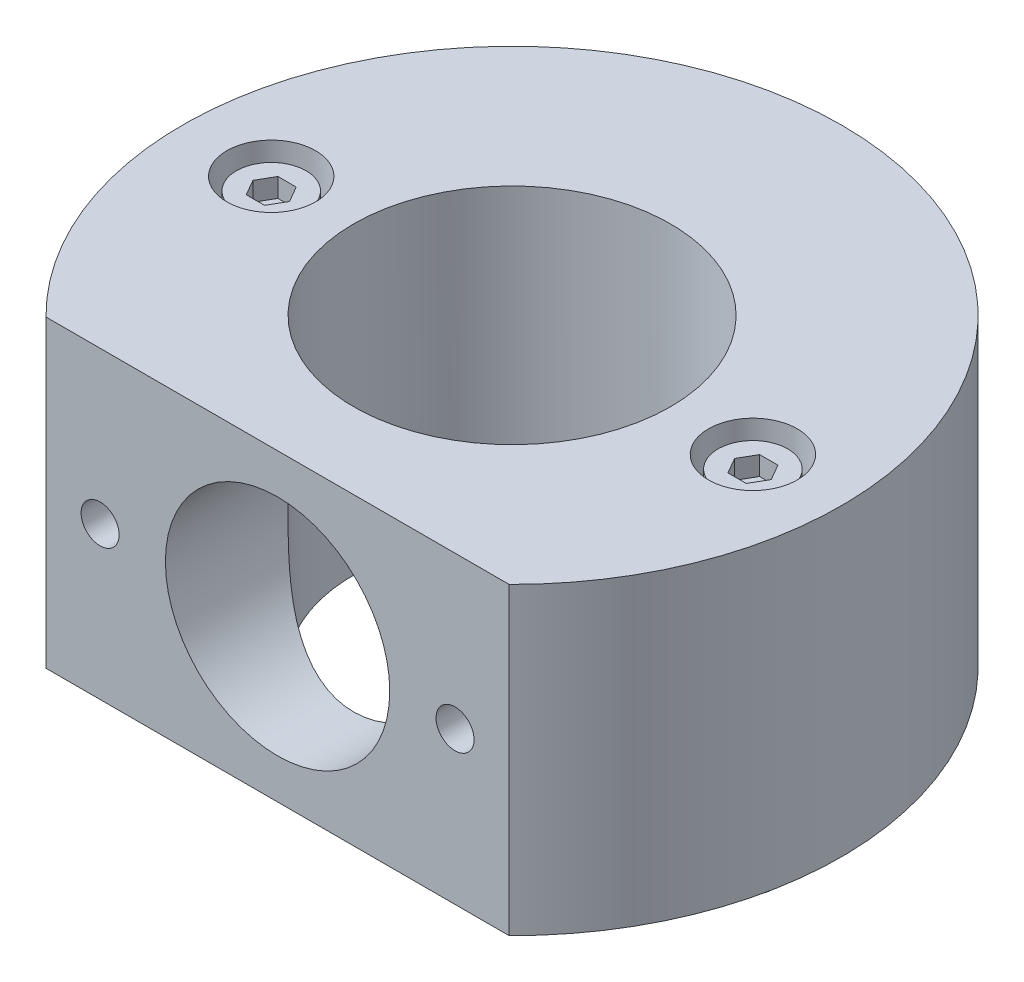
ISO-10303-21;
HEADER;
FILE_DESCRIPTION(('STEP AP214'),'2;1');
FILE_NAME('part.step','',(''),(''),'','','');
FILE_SCHEMA(('AUTOMOTIVE_DESIGN { 1 0 10303 214 1 1 1 1 }'));
ENDSEC;
DATA;
#1=APPLICATION_CONTEXT('core data for automotive mechanical design processes');
#2=APPLICATION_PROTOCOL_DEFINITION('international standard','automotive_design',2000,#1);
#3=PRODUCT_CONTEXT('',#1,'mechanical');
#4=PRODUCT('Part','Part','',(#3));
#5=PRODUCT_RELATED_PRODUCT_CATEGORY('part','',(#4));
#6=PRODUCT_DEFINITION_FORMATION('','',#4);
#7=PRODUCT_DEFINITION_CONTEXT('part definition',#1,'design');
#8=PRODUCT_DEFINITION('design','',#6,#7);
#9=PRODUCT_DEFINITION_SHAPE('','',#8);
#10=(LENGTH_UNIT() NAMED_UNIT(*) SI_UNIT(.MILLI.,.METRE.));
#11=(NAMED_UNIT(*) PLANE_ANGLE_UNIT() SI_UNIT($,.RADIAN.));
#12=(NAMED_UNIT(*) SI_UNIT($,.STERADIAN.) SOLID_ANGLE_UNIT());
#13=UNCERTAINTY_MEASURE_WITH_UNIT(LENGTH_MEASURE(1.E-05),#10,'distance_accuracy_value','');
#14=(GEOMETRIC_REPRESENTATION_CONTEXT(3) GLOBAL_UNCERTAINTY_ASSIGNED_CONTEXT((#13)) GLOBAL_UNIT_ASSIGNED_CONTEXT((#10,
#11,#12)) REPRESENTATION_CONTEXT('',''));
#15=CARTESIAN_POINT('',(0.,0.,0.));
#16=DIRECTION('',(0.,0.,1.));
#17=DIRECTION('',(1.,0.,0.));
#18=AXIS2_PLACEMENT_3D('',#15,#16,#17);
#19=CARTESIAN_POINT('',(-1.6759110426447E-13,24.,0.));
#20=DIRECTION('',(0.,-1.,0.));
#21=DIRECTION('',(1.,0.,0.));
#22=AXIS2_PLACEMENT_3D('',#19,#20,#21);
#23=CYLINDRICAL_SURFACE('',#22,12.5);
#24=CARTESIAN_POINT('',(0.,0.,0.));
#25=DIRECTION('',(0.,-1.,0.));
#26=DIRECTION('',(1.,0.,0.));
#27=AXIS2_PLACEMENT_3D('',#24,#25,#26);
#28=CIRCLE('',#27,12.5);
#29=CARTESIAN_POINT('',(12.5,0.,0.));
#30=VERTEX_POINT('',#29);
#31=EDGE_CURVE('E269',#30,#30,#28,.T.);
#32=ORIENTED_EDGE('',*,*,#31,.T.);
#33=EDGE_LOOP('',(#32));
#34=FACE_BOUND('',#33,.T.);
#35=CARTESIAN_POINT('',(0.,3.15000000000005,12.5));
#36=CARTESIAN_POINT('',(0.219425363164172,3.15000033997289,12.4999996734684));
#37=CARTESIAN_POINT('',(0.438855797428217,3.15817231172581,12.4942099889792));
#38=CARTESIAN_POINT('',(0.875903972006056,3.190725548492,12.4711942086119));
#39=CARTESIAN_POINT('',(1.09352166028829,3.21510727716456,12.4539677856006));
#40=CARTESIAN_POINT('',(1.52532019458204,3.2797029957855,12.4084871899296));
#41=CARTESIAN_POINT('',(1.7394993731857,3.3199244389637,12.3802278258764));
#42=CARTESIAN_POINT('',(2.16276216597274,3.4155930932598,12.3133412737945));
#43=CARTESIAN_POINT('',(2.37184574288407,3.47104041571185,12.2747140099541));
#44=CARTESIAN_POINT('',(2.78248715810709,3.59606693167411,12.1881732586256));
#45=CARTESIAN_POINT('',(2.9840790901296,3.66556944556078,12.1403102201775));
#46=CARTESIAN_POINT('',(3.37990285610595,3.81808308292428,12.0361190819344));
#47=CARTESIAN_POINT('',(3.57413176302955,3.9010995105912,11.9797876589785));
#48=CARTESIAN_POINT('',(3.95422329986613,4.07972853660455,11.8597565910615));
#49=CARTESIAN_POINT('',(4.14008917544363,4.17533619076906,11.7960598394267));
#50=CARTESIAN_POINT('',(4.5029556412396,4.37837699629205,11.662366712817));
#51=CARTESIAN_POINT('',(4.67995290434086,4.4858145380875,11.5923680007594));
#52=CARTESIAN_POINT('',(5.03984349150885,4.72175857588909,11.4407784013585));
#53=CARTESIAN_POINT('',(5.22186422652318,4.85128883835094,11.3587101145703));
#54=CARTESIAN_POINT('',(5.5743037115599,5.12256565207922,11.1899651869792));
#55=CARTESIAN_POINT('',(5.74472108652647,5.2643136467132,11.1032880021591));
#56=CARTESIAN_POINT('',(6.0738466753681,5.55951634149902,10.9267246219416));
#57=CARTESIAN_POINT('',(6.23253664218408,5.71298855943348,10.8368337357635));
#58=CARTESIAN_POINT('',(6.53757337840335,6.03081749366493,10.6555902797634));
#59=CARTESIAN_POINT('',(6.6839238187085,6.19517094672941,10.5642381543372));
#60=CARTESIAN_POINT('',(6.98937549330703,6.56505724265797,10.3652098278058));
#61=CARTESIAN_POINT('',(7.14599891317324,6.77266320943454,10.2575680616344));
#62=CARTESIAN_POINT('',(7.44111259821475,7.20205984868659,10.0455395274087));
#63=CARTESIAN_POINT('',(7.57959802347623,7.42385428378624,9.94115363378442));
#64=CARTESIAN_POINT('',(7.83736766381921,7.88090741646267,9.73922159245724));
#65=CARTESIAN_POINT('',(7.95667563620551,8.1161489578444,9.64166706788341));
#66=CARTESIAN_POINT('',(8.17505073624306,8.59979967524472,9.45721782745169));
#67=CARTESIAN_POINT('',(8.2741287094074,8.84820170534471,9.3703174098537));
#68=CARTESIAN_POINT('',(8.42253775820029,9.27654417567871,9.23674388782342));
#69=CARTESIAN_POINT('',(8.47768342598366,9.45323257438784,9.18605004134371));
#70=CARTESIAN_POINT('',(8.57722486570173,9.81178029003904,9.09317595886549));
#71=CARTESIAN_POINT('',(8.62162389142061,9.99363802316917,9.050993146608));
#72=CARTESIAN_POINT('',(8.69901874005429,10.3614560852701,8.97663395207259));
#73=CARTESIAN_POINT('',(8.73203414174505,10.5474087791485,8.94444039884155));
#74=CARTESIAN_POINT('',(8.78622249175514,10.9226338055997,8.89121727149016));
#75=CARTESIAN_POINT('',(8.8073954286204,11.1119061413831,8.87018770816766));
#76=CARTESIAN_POINT('',(8.83758427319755,11.4935714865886,8.84011131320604));
#77=CARTESIAN_POINT('',(8.84652378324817,11.6859765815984,8.83113979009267));
#78=CARTESIAN_POINT('',(8.85180955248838,12.0711301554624,8.82584175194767));
#79=CARTESIAN_POINT('',(8.84815617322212,12.2638786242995,8.82951487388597));
#80=CARTESIAN_POINT('',(8.82832752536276,12.6482200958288,8.84934040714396));
#81=CARTESIAN_POINT('',(8.81214299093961,12.839812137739,8.86550205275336));
#82=CARTESIAN_POINT('',(8.76757174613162,13.2201950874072,8.90958246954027));
#83=CARTESIAN_POINT('',(8.73918364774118,13.4089856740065,8.93750257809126));
#84=CARTESIAN_POINT('',(8.66614780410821,13.8073898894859,9.00837370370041));
#85=CARTESIAN_POINT('',(8.61983919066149,14.0164318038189,9.05283038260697));
#86=CARTESIAN_POINT('',(8.5130935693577,14.4279596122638,9.15328438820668));
#87=CARTESIAN_POINT('',(8.45265435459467,14.6304444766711,9.20928351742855));
#88=CARTESIAN_POINT('',(8.25118999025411,15.2275192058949,9.39151338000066));
#89=CARTESIAN_POINT('',(8.09010851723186,15.6112522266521,9.53188291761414));
#90=CARTESIAN_POINT('',(7.78559188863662,16.2164374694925,9.78052257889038));
#91=CARTESIAN_POINT('',(7.65578854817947,16.4475960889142,9.88277966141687));
#92=CARTESIAN_POINT('',(7.37716669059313,16.895864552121,10.0924614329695));
#93=CARTESIAN_POINT('',(7.2283430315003,17.1129705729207,10.1998875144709));
#94=CARTESIAN_POINT('',(6.91238201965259,17.5326808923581,10.4166081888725));
#95=CARTESIAN_POINT('',(6.74523037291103,17.7352736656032,10.5259041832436));
#96=CARTESIAN_POINT('',(6.39327037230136,18.1251562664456,10.7433176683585));
#97=CARTESIAN_POINT('',(6.20846375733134,18.3124475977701,10.8514352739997));
#98=CARTESIAN_POINT('',(5.81995406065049,18.6724347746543,11.0647041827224));
#99=CARTESIAN_POINT('',(5.61609767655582,18.8449861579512,11.1698205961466));
#100=CARTESIAN_POINT('',(5.19145716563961,19.1723872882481,11.3733991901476));
#101=CARTESIAN_POINT('',(4.97067140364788,19.3272353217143,11.4718607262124));
#102=CARTESIAN_POINT('',(4.51345299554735,19.6173752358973,11.6593170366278));
#103=CARTESIAN_POINT('',(4.27705128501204,19.7527041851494,11.7483296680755));
#104=CARTESIAN_POINT('',(3.78947394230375,20.0023321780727,11.9145351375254));
#105=CARTESIAN_POINT('',(3.53830389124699,20.1166390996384,11.9917324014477));
#106=CARTESIAN_POINT('',(3.08865001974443,20.2961138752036,12.1140362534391));
#107=CARTESIAN_POINT('',(2.89304592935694,20.3663815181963,12.1623079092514));
#108=CARTESIAN_POINT('',(2.49558984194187,20.4934110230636,12.250037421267));
#109=CARTESIAN_POINT('',(2.29373918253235,20.5501757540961,12.2894971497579));
#110=CARTESIAN_POINT('',(1.88504992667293,20.6494673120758,12.3587831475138));
#111=CARTESIAN_POINT('',(1.67821400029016,20.6920015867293,12.3886144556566));
#112=CARTESIAN_POINT('',(1.26081932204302,20.7622839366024,12.4380261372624));
#113=CARTESIAN_POINT('',(1.05026046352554,20.790031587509,12.4576062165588));
#114=CARTESIAN_POINT('',(0.626335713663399,20.8303834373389,12.4861109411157));
#115=CARTESIAN_POINT('',(0.412963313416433,20.8429421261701,12.4950035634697));
#116=CARTESIAN_POINT('',(-0.0143068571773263,20.8525678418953,12.5018176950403));
#117=CARTESIAN_POINT('',(-0.228204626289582,20.8496349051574,12.4997392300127));
#118=CARTESIAN_POINT('',(-0.65486231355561,20.8283229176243,12.4846597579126));
#119=CARTESIAN_POINT('',(-0.867622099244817,20.809942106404,12.4716575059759));
#120=CARTESIAN_POINT('',(-1.29034828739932,20.7580163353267,12.4350316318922));
#121=CARTESIAN_POINT('',(-1.50031473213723,20.7244716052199,12.4114081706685));
#122=CARTESIAN_POINT('',(-1.90680329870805,20.6445131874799,12.3553362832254));
#123=CARTESIAN_POINT('',(-2.10351047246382,20.5987306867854,12.3233218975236));
#124=CARTESIAN_POINT('',(-2.49192198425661,20.4943088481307,12.2506887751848));
#125=CARTESIAN_POINT('',(-2.683624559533,20.4356650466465,12.2100670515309));
#126=CARTESIAN_POINT('',(-3.06092698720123,20.3062024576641,12.1209856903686));
#127=CARTESIAN_POINT('',(-3.24652843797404,20.2353868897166,12.0725281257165));
#128=CARTESIAN_POINT('',(-3.61095036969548,20.0822411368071,11.9685821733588));
#129=CARTESIAN_POINT('',(-3.78976834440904,19.9999067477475,11.9130912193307));
#130=CARTESIAN_POINT('',(-4.15631067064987,19.8162294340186,11.7904976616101));
#131=CARTESIAN_POINT('',(-4.34330394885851,19.7138289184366,11.7227944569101));
#132=CARTESIAN_POINT('',(-4.70779551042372,19.4969435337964,11.5812309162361));
#133=CARTESIAN_POINT('',(-4.88528973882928,19.3824535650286,11.5073679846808));
#134=CARTESIAN_POINT('',(-5.2303275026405,19.1421561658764,11.3547029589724));
#135=CARTESIAN_POINT('',(-5.39786643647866,19.0163435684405,11.2758986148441));
#136=CARTESIAN_POINT('',(-5.7225777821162,18.7541219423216,11.114628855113));
#137=CARTESIAN_POINT('',(-5.87974901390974,18.6177117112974,11.0321630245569));
#138=CARTESIAN_POINT('',(-6.21073545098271,18.3094525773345,10.8498193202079));
#139=CARTESIAN_POINT('',(-6.38246869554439,18.135639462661,10.749474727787));
#140=CARTESIAN_POINT('',(-6.71073809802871,17.7747734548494,10.5476597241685));
#141=CARTESIAN_POINT('',(-6.86727161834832,17.5877182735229,10.4461891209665));
#142=CARTESIAN_POINT('',(-7.16474323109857,17.200820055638,10.2444502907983));
#143=CARTESIAN_POINT('',(-7.30567426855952,17.0009712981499,10.1441826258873));
#144=CARTESIAN_POINT('',(-7.57126461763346,16.5889551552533,9.94752435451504));
#145=CARTESIAN_POINT('',(-7.69592710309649,16.3767901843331,9.8511329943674));
#146=CARTESIAN_POINT('',(-7.90854806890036,15.9773767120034,9.68091714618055));
#147=CARTESIAN_POINT('',(-7.9991482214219,15.7919840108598,9.6060333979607));
#148=CARTESIAN_POINT('',(-8.16798177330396,15.4131466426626,9.46289178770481));
#149=CARTESIAN_POINT('',(-8.2462154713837,15.219702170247,9.39463376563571));
#150=CARTESIAN_POINT('',(-8.38944318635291,14.8255324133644,9.26695408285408));
#151=CARTESIAN_POINT('',(-8.4544602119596,14.6248205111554,9.20751711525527));
#152=CARTESIAN_POINT('',(-8.57055873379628,14.2165356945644,9.09955064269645));
#153=CARTESIAN_POINT('',(-8.62164328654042,14.0089642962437,9.0510187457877));
#154=CARTESIAN_POINT('',(-8.70143667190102,13.6245296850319,8.97426935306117));
#155=CARTESIAN_POINT('',(-8.73248720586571,13.4485629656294,8.94399026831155));
#156=CARTESIAN_POINT('',(-8.78399093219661,13.0936788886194,8.89341407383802));
#157=CARTESIAN_POINT('',(-8.80444626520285,12.9147621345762,8.87311494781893));
#158=CARTESIAN_POINT('',(-8.8344045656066,12.5552519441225,8.84328822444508));
#159=CARTESIAN_POINT('',(-8.843915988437,12.3746599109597,8.83375231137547));
#160=CARTESIAN_POINT('',(-8.85183872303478,12.0129806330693,8.82581351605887));
#161=CARTESIAN_POINT('',(-8.85024982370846,11.8318933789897,8.82741084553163));
#162=CARTESIAN_POINT('',(-8.83600581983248,11.4707105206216,8.84166839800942));
#163=CARTESIAN_POINT('',(-8.82335754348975,11.2906143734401,8.85432179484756));
#164=CARTESIAN_POINT('',(-8.78723546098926,10.9325868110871,8.89017070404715));
#165=CARTESIAN_POINT('',(-8.76376170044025,10.7546553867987,8.91336617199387));
#166=CARTESIAN_POINT('',(-8.70634379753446,10.4018583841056,8.96945837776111));
#167=CARTESIAN_POINT('',(-8.67238843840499,10.2269963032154,9.002365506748));
#168=CARTESIAN_POINT('',(-8.59447734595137,9.88130149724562,9.07677567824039));
#169=CARTESIAN_POINT('',(-8.55051589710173,9.71047113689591,9.11828363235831));
#170=CARTESIAN_POINT('',(-8.43591365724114,9.31408585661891,9.22461030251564));
#171=CARTESIAN_POINT('',(-8.36133195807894,9.09048361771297,9.29248695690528));
#172=CARTESIAN_POINT('',(-8.19596972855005,8.65285905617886,9.43865718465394));
#173=CARTESIAN_POINT('',(-8.10518243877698,8.43884077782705,9.51695510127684));
#174=CARTESIAN_POINT('',(-7.90829374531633,8.02069633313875,9.68118492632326));
#175=CARTESIAN_POINT('',(-7.80217351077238,7.81658274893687,9.76712617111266));
#176=CARTESIAN_POINT('',(-7.57548806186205,7.41885653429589,9.94397538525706));
#177=CARTESIAN_POINT('',(-7.4549239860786,7.22524307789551,10.0348829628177));
#178=CARTESIAN_POINT('',(-7.19669650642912,6.84399411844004,10.2217217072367));
#179=CARTESIAN_POINT('',(-7.05867818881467,6.65663303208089,10.3177217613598));
#180=CARTESIAN_POINT('',(-6.7684632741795,6.29347289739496,10.5103880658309));
#181=CARTESIAN_POINT('',(-6.61626144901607,6.11767815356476,10.6070545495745));
#182=CARTESIAN_POINT('',(-6.29805562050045,5.77817319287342,10.7990290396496));
#183=CARTESIAN_POINT('',(-6.13204904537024,5.61446523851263,10.894336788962));
#184=CARTESIAN_POINT('',(-5.78661562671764,5.29983904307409,11.0816826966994));
#185=CARTESIAN_POINT('',(-5.60718909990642,5.14892050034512,11.1737209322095));
#186=CARTESIAN_POINT('',(-5.20735719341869,4.8390549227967,11.3661668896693));
#187=CARTESIAN_POINT('',(-4.98484368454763,4.68230391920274,11.465756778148));
#188=CARTESIAN_POINT('',(-4.52335939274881,4.38839354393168,11.6555337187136));
#189=CARTESIAN_POINT('',(-4.28438585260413,4.2512374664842,11.7457191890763));
#190=CARTESIAN_POINT('',(-3.79166056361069,3.99860461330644,11.9138977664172));
#191=CARTESIAN_POINT('',(-3.53793366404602,3.88309269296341,11.9919106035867));
#192=CARTESIAN_POINT('',(-3.01722013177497,3.67549742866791,12.1333864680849));
#193=CARTESIAN_POINT('',(-2.75023954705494,3.58340351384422,12.1968560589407));
#194=CARTESIAN_POINT('',(-2.27931937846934,3.44605125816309,12.2921037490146));
#195=CARTESIAN_POINT('',(-2.07788071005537,3.39486311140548,12.3278097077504));
#196=CARTESIAN_POINT('',(-1.67049951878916,3.30659227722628,12.3895859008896));
#197=CARTESIAN_POINT('',(-1.46455795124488,3.26950662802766,12.4156581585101));
#198=CARTESIAN_POINT('',(-1.04965560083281,3.2099702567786,12.457595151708));
#199=CARTESIAN_POINT('',(-0.840696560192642,3.18751140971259,12.4734655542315));
#200=CARTESIAN_POINT('',(-0.421159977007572,3.15752560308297,12.4946684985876));
#201=CARTESIAN_POINT('',(-0.210582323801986,3.14999967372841,12.5000003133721));
#202=CARTESIAN_POINT('',(0.,3.15000000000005,12.5));
#203=B_SPLINE_CURVE_WITH_KNOTS('',3,(#35,#36,#37,#38,#39,#40,#41,#42,#43,#44,#45,#46,#47,#48,
#49,#50,#51,#52,#53,#54,#55,#56,#57,#58,#59,#60,#61,#62,#63,#64,#65,#66,#67,#68,#69,#70,#71,#72,
#73,#74,#75,#76,#77,#78,#79,#80,#81,#82,#83,#84,#85,#86,#87,#88,#89,#90,#91,#92,#93,#94,#95,#96,
#97,#98,#99,#100,#101,#102,#103,#104,#105,#106,#107,#108,#109,#110,#111,#112,#113,#114,#115,
#116,#117,#118,#119,#120,#121,#122,#123,#124,#125,#126,#127,#128,#129,#130,#131,#132,#133,#134,
#135,#136,#137,#138,#139,#140,#141,#142,#143,#144,#145,#146,#147,#148,#149,#150,#151,#152,#153,
#154,#155,#156,#157,#158,#159,#160,#161,#162,#163,#164,#165,#166,#167,#168,#169,#170,#171,#172,
#173,#174,#175,#176,#177,#178,#179,#180,#181,#182,#183,#184,#185,#186,#187,#188,#189,#190,#191,
#192,#193,#194,#195,#196,#197,#198,#199,#200,#201,#202),.UNSPECIFIED.,.T.,.F.,(4,2,2,2,2,2,2,2,
2,2,2,2,2,2,2,2,2,2,2,2,2,2,2,2,2,2,2,2,2,2,2,2,2,2,2,2,2,2,2,2,2,2,2,2,2,2,2,2,2,2,2,2,2,2,2,2,
2,2,2,2,2,2,2,2,2,2,2,2,2,2,2,2,2,2,2,2,2,2,2,2,2,2,2,4),(0.,0.658058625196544,1.31613607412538,
1.97452354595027,2.63291583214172,3.28780865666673,3.94295914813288,4.59785314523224,
5.25299101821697,5.96631688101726,6.67972712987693,7.3942249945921,8.10850954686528,
8.95192182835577,9.79555870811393,10.6381422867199,11.4802729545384,12.0555173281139,
12.6305873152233,13.204663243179,13.7787397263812,14.3563851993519,14.9340140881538,
15.5120704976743,16.0901926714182,16.7452377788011,17.4003852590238,18.7121451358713,
19.5637485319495,20.4155826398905,21.2680858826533,22.1205052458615,22.9804981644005,
23.8405742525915,24.6989948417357,25.5570930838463,26.1965768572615,26.8359246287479,
27.4749372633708,28.1139682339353,28.7549092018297,29.3958486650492,30.0368611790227,
30.6778639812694,31.2906622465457,31.9036735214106,32.5165228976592,33.1295965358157,
33.8000062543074,34.4706999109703,35.141701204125,35.8127787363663,36.6044067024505,
37.3961717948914,38.1882934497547,38.9802603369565,39.6382657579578,40.2962552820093,
40.953089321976,41.6097791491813,42.1529158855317,42.6959428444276,43.2385499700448,
43.7811674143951,44.3234500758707,44.8657304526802,45.408593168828,45.9517667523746,
46.6865440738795,47.4216285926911,48.1576236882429,48.8935608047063,49.6480818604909,
50.4028821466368,51.1578233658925,51.9127467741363,52.7810026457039,53.6494043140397,
54.51638346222,55.3829705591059,56.0149493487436,56.646795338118,57.278290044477,
57.9098283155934),.UNSPECIFIED.);
#204=CARTESIAN_POINT('',(0.,3.15000000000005,12.5));
#205=VERTEX_POINT('',#204);
#206=EDGE_CURVE('E19',#205,#205,#203,.T.);
#207=ORIENTED_EDGE('',*,*,#206,.T.);
#208=EDGE_LOOP('',(#207));
#209=FACE_BOUND('',#208,.T.);
#210=CARTESIAN_POINT('',(-1.6759110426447E-13,24.,0.));
#211=DIRECTION('',(0.,1.,0.));
#212=DIRECTION('',(-1.,0.,0.));
#213=AXIS2_PLACEMENT_3D('',#210,#211,#212);
#214=CIRCLE('',#213,12.5);
#215=CARTESIAN_POINT('',(-12.5000000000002,23.9999999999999,0.));
#216=VERTEX_POINT('',#215);
#217=EDGE_CURVE('E288',#216,#216,#214,.T.);
#218=ORIENTED_EDGE('',*,*,#217,.T.);
#219=EDGE_LOOP('',(#218));
#220=FACE_BOUND('',#219,.T.);
#221=ADVANCED_FACE('F15',(#34,#209,#220),#23,.F.);
#222=CARTESIAN_POINT('',(-1.6759110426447E-13,24.,0.));
#223=DIRECTION('',(0.,1.,0.));
#224=DIRECTION('',(-1.,0.,0.));
#225=AXIS2_PLACEMENT_3D('',#222,#223,#224);
#226=PLANE('',#225);
#227=CARTESIAN_POINT('',(19.,24.,0.));
#228=DIRECTION('',(0.,1.,0.));
#229=DIRECTION('',(-1.,0.,0.));
#230=AXIS2_PLACEMENT_3D('',#227,#228,#229);
#231=CIRCLE('',#230,3.5);
#232=CARTESIAN_POINT('',(15.5,24.,0.));
#233=VERTEX_POINT('',#232);
#234=EDGE_CURVE('E291',#233,#233,#231,.T.);
#235=ORIENTED_EDGE('',*,*,#234,.F.);
#236=EDGE_LOOP('',(#235));
#237=FACE_BOUND('',#236,.T.);
#238=ORIENTED_EDGE('',*,*,#217,.F.);
#239=EDGE_LOOP('',(#238));
#240=FACE_BOUND('',#239,.T.);
#241=CARTESIAN_POINT('',(-19.,24.,0.));
#242=DIRECTION('',(0.,1.,0.));
#243=DIRECTION('',(-1.,0.,0.));
#244=AXIS2_PLACEMENT_3D('',#241,#242,#243);
#245=CIRCLE('',#244,3.5);
#246=CARTESIAN_POINT('',(-22.5,24.,0.));
#247=VERTEX_POINT('',#246);
#248=EDGE_CURVE('E285',#247,#247,#245,.T.);
#249=ORIENTED_EDGE('',*,*,#248,.F.);
#250=EDGE_LOOP('',(#249));
#251=FACE_BOUND('',#250,.T.);
#252=DIRECTION('',(-1.,0.,0.));
#253=VECTOR('',#252,1.);
#254=CARTESIAN_POINT('',(-1.67591104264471E-13,24.,18.5));
#255=LINE('',#254,#253);
#256=CARTESIAN_POINT('',(18.2688259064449,24.,18.5));
#257=VERTEX_POINT('',#256);
#258=CARTESIAN_POINT('',(-18.2688259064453,24.,18.5));
#259=VERTEX_POINT('',#258);
#260=EDGE_CURVE('E280',#257,#259,#255,.T.);
#261=ORIENTED_EDGE('',*,*,#260,.F.);
#262=CARTESIAN_POINT('',(-1.6759110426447E-13,24.,0.));
#263=DIRECTION('',(0.,1.,0.));
#264=DIRECTION('',(-1.,0.,0.));
#265=AXIS2_PLACEMENT_3D('',#262,#263,#264);
#266=CIRCLE('',#265,26.);
#267=EDGE_CURVE('E282',#257,#259,#266,.T.);
#268=ORIENTED_EDGE('',*,*,#267,.T.);
#269=EDGE_LOOP('',(#261,#268));
#270=FACE_BOUND('',#269,.T.);
#271=ADVANCED_FACE('F322',(#237,#240,#251,#270),#226,.T.);
#272=CARTESIAN_POINT('',(0.,0.,0.));
#273=DIRECTION('',(0.,1.,0.));
#274=DIRECTION('',(-1.,0.,0.));
#275=AXIS2_PLACEMENT_3D('',#272,#273,#274);
#276=PLANE('',#275);
#277=DIRECTION('',(1.,0.,0.));
#278=VECTOR('',#277,1.);
#279=CARTESIAN_POINT('',(0.,0.,18.5));
#280=LINE('',#279,#278);
#281=CARTESIAN_POINT('',(-18.2688259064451,0.,18.5));
#282=VERTEX_POINT('',#281);
#283=CARTESIAN_POINT('',(18.2688259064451,1.92162934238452E-13,18.5));
#284=VERTEX_POINT('',#283);
#285=EDGE_CURVE('E275',#282,#284,#280,.T.);
#286=ORIENTED_EDGE('',*,*,#285,.F.);
#287=CARTESIAN_POINT('',(0.,0.,0.));
#288=DIRECTION('',(0.,-1.,0.));
#289=DIRECTION('',(1.,0.,0.));
#290=AXIS2_PLACEMENT_3D('',#287,#288,#289);
#291=CIRCLE('',#290,26.);
#292=EDGE_CURVE('E277',#282,#284,#291,.T.);
#293=ORIENTED_EDGE('',*,*,#292,.T.);
#294=EDGE_LOOP('',(#286,#293));
#295=FACE_BOUND('',#294,.T.);
#296=CARTESIAN_POINT('',(-19.,-1.32676290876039E-13,0.));
#297=DIRECTION('',(0.,-1.,0.));
#298=DIRECTION('',(1.,0.,0.));
#299=AXIS2_PLACEMENT_3D('',#296,#297,#298);
#300=CIRCLE('',#299,1.75);
#301=CARTESIAN_POINT('',(-17.25,-1.20456106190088E-13,0.));
#302=VERTEX_POINT('',#301);
#303=EDGE_CURVE('E272',#302,#302,#300,.T.);
#304=ORIENTED_EDGE('',*,*,#303,.F.);
#305=EDGE_LOOP('',(#304));
#306=FACE_BOUND('',#305,.T.);
#307=ORIENTED_EDGE('',*,*,#31,.F.);
#308=EDGE_LOOP('',(#307));
#309=FACE_BOUND('',#308,.T.);
#310=CARTESIAN_POINT('',(19.,1.32676290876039E-13,0.));
#311=DIRECTION('',(0.,-1.,0.));
#312=DIRECTION('',(1.,0.,0.));
#313=AXIS2_PLACEMENT_3D('',#310,#311,#312);
#314=CIRCLE('',#313,1.75);
#315=CARTESIAN_POINT('',(20.75,1.4489647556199E-13,0.));
#316=VERTEX_POINT('',#315);
#317=EDGE_CURVE('E266',#316,#316,#314,.T.);
#318=ORIENTED_EDGE('',*,*,#317,.F.);
#319=EDGE_LOOP('',(#318));
#320=FACE_BOUND('',#319,.T.);
#321=ADVANCED_FACE('F328',(#295,#306,#309,#320),#276,.F.);
#322=CARTESIAN_POINT('',(-1.6759110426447E-13,24.,0.));
#323=DIRECTION('',(0.,-1.,0.));
#324=DIRECTION('',(1.,0.,0.));
#325=AXIS2_PLACEMENT_3D('',#322,#323,#324);
#326=CYLINDRICAL_SURFACE('',#325,26.);
#327=ORIENTED_EDGE('',*,*,#292,.F.);
#328=DIRECTION('',(0.,-1.,0.));
#329=VECTOR('',#328,1.);
#330=CARTESIAN_POINT('',(-18.2688259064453,24.,18.5));
#331=LINE('',#330,#329);
#332=EDGE_CURVE('E10',#259,#282,#331,.T.);
#333=ORIENTED_EDGE('',*,*,#332,.F.);
#334=ORIENTED_EDGE('',*,*,#267,.F.);
#335=DIRECTION('',(0.,-1.,0.));
#336=VECTOR('',#335,1.);
#337=CARTESIAN_POINT('',(18.2688259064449,24.,18.5));
#338=LINE('',#337,#336);
#339=EDGE_CURVE('E29',#257,#284,#338,.T.);
#340=ORIENTED_EDGE('',*,*,#339,.T.);
#341=EDGE_LOOP('',(#327,#333,#334,#340));
#342=FACE_BOUND('',#341,.T.);
#343=ADVANCED_FACE('F17',(#342),#326,.T.);
#344=CARTESIAN_POINT('',(18.2688259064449,24.,18.5));
#345=DIRECTION('',(0.,0.,-1.));
#346=DIRECTION('',(0.,-1.,0.));
#347=AXIS2_PLACEMENT_3D('',#344,#345,#346);
#348=PLANE('',#347);
#349=CARTESIAN_POINT('',(14.,12.0000000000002,18.5));
#350=DIRECTION('',(0.,0.,1.));
#351=DIRECTION('',(0.,1.,0.));
#352=AXIS2_PLACEMENT_3D('',#349,#350,#351);
#353=CIRCLE('',#352,1.5);
#354=CARTESIAN_POINT('',(14.,13.5000000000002,18.5));
#355=VERTEX_POINT('',#354);
#356=EDGE_CURVE('E251',#355,#355,#353,.T.);
#357=ORIENTED_EDGE('',*,*,#356,.F.);
#358=EDGE_LOOP('',(#357));
#359=FACE_BOUND('',#358,.T.);
#360=CARTESIAN_POINT('',(-14.,12.,18.5));
#361=DIRECTION('',(0.,0.,1.));
#362=DIRECTION('',(0.,1.,0.));
#363=AXIS2_PLACEMENT_3D('',#360,#361,#362);
#364=CIRCLE('',#363,1.5);
#365=CARTESIAN_POINT('',(-14.,13.5,18.5));
#366=VERTEX_POINT('',#365);
#367=EDGE_CURVE('E255',#366,#366,#364,.T.);
#368=ORIENTED_EDGE('',*,*,#367,.F.);
#369=EDGE_LOOP('',(#368));
#370=FACE_BOUND('',#369,.T.);
#371=ORIENTED_EDGE('',*,*,#285,.T.);
#372=ORIENTED_EDGE('',*,*,#339,.F.);
#373=ORIENTED_EDGE('',*,*,#260,.T.);
#374=ORIENTED_EDGE('',*,*,#332,.T.);
#375=EDGE_LOOP('',(#371,#372,#373,#374));
#376=FACE_BOUND('',#375,.T.);
#377=CARTESIAN_POINT('',(0.,12.,18.5));
#378=DIRECTION('',(0.,0.,1.));
#379=DIRECTION('',(0.,1.,0.));
#380=AXIS2_PLACEMENT_3D('',#377,#378,#379);
#381=CIRCLE('',#380,8.85);
#382=CARTESIAN_POINT('',(-1.45594771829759E-13,20.85,18.5));
#383=VERTEX_POINT('',#382);
#384=EDGE_CURVE('E261',#383,#383,#381,.T.);
#385=ORIENTED_EDGE('',*,*,#384,.F.);
#386=EDGE_LOOP('',(#385));
#387=FACE_BOUND('',#386,.T.);
#388=ADVANCED_FACE('F308',(#359,#370,#376,#387),#348,.F.);
#389=CARTESIAN_POINT('',(0.,12.,18.5));
#390=DIRECTION('',(0.,0.,-1.));
#391=DIRECTION('',(0.,-1.,0.));
#392=AXIS2_PLACEMENT_3D('',#389,#390,#391);
#393=CYLINDRICAL_SURFACE('',#392,8.85);
#394=ORIENTED_EDGE('',*,*,#384,.T.);
#395=EDGE_LOOP('',(#394));
#396=FACE_BOUND('',#395,.T.);
#397=ORIENTED_EDGE('',*,*,#206,.F.);
#398=EDGE_LOOP('',(#397));
#399=FACE_BOUND('',#398,.T.);
#400=ADVANCED_FACE('F305',(#396,#399),#393,.F.);
#401=CARTESIAN_POINT('',(19.,24.,0.));
#402=DIRECTION('',(0.,1.,0.));
#403=DIRECTION('',(-1.,0.,0.));
#404=AXIS2_PLACEMENT_3D('',#401,#402,#403);
#405=CYLINDRICAL_SURFACE('',#404,1.75);
#406=CARTESIAN_POINT('',(19.,20.,0.));
#407=DIRECTION('',(0.,-1.,0.));
#408=DIRECTION('',(1.,0.,0.));
#409=AXIS2_PLACEMENT_3D('',#406,#407,#408);
#410=CIRCLE('',#409,1.75);
#411=CARTESIAN_POINT('',(20.75,20.,0.));
#412=VERTEX_POINT('',#411);
#413=EDGE_CURVE('E248',#412,#412,#410,.F.);
#414=ORIENTED_EDGE('',*,*,#413,.T.);
#415=EDGE_LOOP('',(#414));
#416=FACE_BOUND('',#415,.T.);
#417=ORIENTED_EDGE('',*,*,#317,.T.);
#418=EDGE_LOOP('',(#417));
#419=FACE_BOUND('',#418,.T.);
#420=ADVANCED_FACE('F307',(#416,#419),#405,.F.);
#421=CARTESIAN_POINT('',(15.5,20.,0.));
#422=DIRECTION('',(0.,-1.,0.));
#423=DIRECTION('',(1.,0.,0.));
#424=AXIS2_PLACEMENT_3D('',#421,#422,#423);
#425=PLANE('',#424);
#426=CARTESIAN_POINT('',(19.,20.,0.));
#427=DIRECTION('',(0.,1.,0.));
#428=DIRECTION('',(-0.866025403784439,0.,-0.5));
#429=AXIS2_PLACEMENT_3D('',#426,#427,#428);
#430=CIRCLE('',#429,2.75);
#431=CARTESIAN_POINT('',(16.6184301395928,20.,-1.37500000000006));
#432=VERTEX_POINT('',#431);
#433=EDGE_CURVE('E239',#432,#432,#430,.T.);
#434=ORIENTED_EDGE('',*,*,#433,.F.);
#435=EDGE_LOOP('',(#434));
#436=FACE_BOUND('',#435,.T.);
#437=CARTESIAN_POINT('',(19.,20.,0.));
#438=DIRECTION('',(0.,1.,0.));
#439=DIRECTION('',(-1.,0.,0.));
#440=AXIS2_PLACEMENT_3D('',#437,#438,#439);
#441=CIRCLE('',#440,3.5);
#442=CARTESIAN_POINT('',(15.5,20.,0.));
#443=VERTEX_POINT('',#442);
#444=EDGE_CURVE('E297',#443,#443,#441,.T.);
#445=ORIENTED_EDGE('',*,*,#444,.T.);
#446=EDGE_LOOP('',(#445));
#447=FACE_BOUND('',#446,.T.);
#448=ADVANCED_FACE('F316',(#436,#447),#425,.F.);
#449=CARTESIAN_POINT('',(19.,24.,0.));
#450=DIRECTION('',(0.,1.,0.));
#451=DIRECTION('',(-1.,0.,0.));
#452=AXIS2_PLACEMENT_3D('',#449,#450,#451);
#453=CYLINDRICAL_SURFACE('',#452,3.5);
#454=ORIENTED_EDGE('',*,*,#234,.T.);
#455=EDGE_LOOP('',(#454));
#456=FACE_BOUND('',#455,.T.);
#457=ORIENTED_EDGE('',*,*,#444,.F.);
#458=EDGE_LOOP('',(#457));
#459=FACE_BOUND('',#458,.T.);
#460=ADVANCED_FACE('F351',(#456,#459),#453,.F.);
#461=CARTESIAN_POINT('',(-19.,24.,0.));
#462=DIRECTION('',(0.,1.,0.));
#463=DIRECTION('',(-1.,0.,0.));
#464=AXIS2_PLACEMENT_3D('',#461,#462,#463);
#465=CYLINDRICAL_SURFACE('',#464,1.75);
#466=CARTESIAN_POINT('',(-19.,20.,0.));
#467=DIRECTION('',(0.,-1.,0.));
#468=DIRECTION('',(1.,0.,0.));
#469=AXIS2_PLACEMENT_3D('',#466,#467,#468);
#470=CIRCLE('',#469,1.75);
#471=CARTESIAN_POINT('',(-17.25,20.,0.));
#472=VERTEX_POINT('',#471);
#473=EDGE_CURVE('E184',#472,#472,#470,.F.);
#474=ORIENTED_EDGE('',*,*,#473,.T.);
#475=EDGE_LOOP('',(#474));
#476=FACE_BOUND('',#475,.T.);
#477=ORIENTED_EDGE('',*,*,#303,.T.);
#478=EDGE_LOOP('',(#477));
#479=FACE_BOUND('',#478,.T.);
#480=ADVANCED_FACE('F348',(#476,#479),#465,.F.);
#481=CARTESIAN_POINT('',(-22.5,20.,0.));
#482=DIRECTION('',(0.,-1.,0.));
#483=DIRECTION('',(1.,0.,0.));
#484=AXIS2_PLACEMENT_3D('',#481,#482,#483);
#485=PLANE('',#484);
#486=CARTESIAN_POINT('',(-19.,20.,0.));
#487=DIRECTION('',(0.,1.,0.));
#488=DIRECTION('',(-0.866025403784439,0.,-0.5));
#489=AXIS2_PLACEMENT_3D('',#486,#487,#488);
#490=CIRCLE('',#489,2.75);
#491=CARTESIAN_POINT('',(-21.3815698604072,20.,-1.37500000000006));
#492=VERTEX_POINT('',#491);
#493=EDGE_CURVE('E175',#492,#492,#490,.T.);
#494=ORIENTED_EDGE('',*,*,#493,.F.);
#495=EDGE_LOOP('',(#494));
#496=FACE_BOUND('',#495,.T.);
#497=CARTESIAN_POINT('',(-19.,20.,0.));
#498=DIRECTION('',(0.,1.,0.));
#499=DIRECTION('',(-1.,0.,0.));
#500=AXIS2_PLACEMENT_3D('',#497,#498,#499);
#501=CIRCLE('',#500,3.5);
#502=CARTESIAN_POINT('',(-22.5,20.,0.));
#503=VERTEX_POINT('',#502);
#504=EDGE_CURVE('E294',#503,#503,#501,.T.);
#505=ORIENTED_EDGE('',*,*,#504,.T.);
#506=EDGE_LOOP('',(#505));
#507=FACE_BOUND('',#506,.T.);
#508=ADVANCED_FACE('F350',(#496,#507),#485,.F.);
#509=CARTESIAN_POINT('',(-19.,24.,0.));
#510=DIRECTION('',(0.,1.,0.));
#511=DIRECTION('',(-1.,0.,0.));
#512=AXIS2_PLACEMENT_3D('',#509,#510,#511);
#513=CYLINDRICAL_SURFACE('',#512,3.5);
#514=ORIENTED_EDGE('',*,*,#248,.T.);
#515=EDGE_LOOP('',(#514));
#516=FACE_BOUND('',#515,.T.);
#517=ORIENTED_EDGE('',*,*,#504,.F.);
#518=EDGE_LOOP('',(#517));
#519=FACE_BOUND('',#518,.T.);
#520=ADVANCED_FACE('F359',(#516,#519),#513,.F.);
#521=CARTESIAN_POINT('',(-14.,12.,12.5));
#522=DIRECTION('',(0.,0.,1.));
#523=DIRECTION('',(0.,1.,0.));
#524=AXIS2_PLACEMENT_3D('',#521,#522,#523);
#525=PLANE('',#524);
#526=CARTESIAN_POINT('',(-14.,12.,12.5));
#527=DIRECTION('',(0.,0.,1.));
#528=DIRECTION('',(0.,1.,0.));
#529=AXIS2_PLACEMENT_3D('',#526,#527,#528);
#530=CIRCLE('',#529,1.5);
#531=CARTESIAN_POINT('',(-14.,13.5,12.5));
#532=VERTEX_POINT('',#531);
#533=EDGE_CURVE('E258',#532,#532,#530,.T.);
#534=ORIENTED_EDGE('',*,*,#533,.T.);
#535=EDGE_LOOP('',(#534));
#536=FACE_BOUND('',#535,.T.);
#537=ADVANCED_FACE('F448',(#536),#525,.T.);
#538=CARTESIAN_POINT('',(-14.,12.,12.5));
#539=DIRECTION('',(0.,0.,1.));
#540=DIRECTION('',(0.,1.,0.));
#541=AXIS2_PLACEMENT_3D('',#538,#539,#540);
#542=CYLINDRICAL_SURFACE('',#541,1.5);
#543=ORIENTED_EDGE('',*,*,#533,.F.);
#544=EDGE_LOOP('',(#543));
#545=FACE_BOUND('',#544,.T.);
#546=ORIENTED_EDGE('',*,*,#367,.T.);
#547=EDGE_LOOP('',(#546));
#548=FACE_BOUND('',#547,.T.);
#549=ADVANCED_FACE('F443',(#545,#548),#542,.F.);
#550=CARTESIAN_POINT('',(14.,12.0000000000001,12.5));
#551=DIRECTION('',(0.,0.,1.));
#552=DIRECTION('',(0.,1.,0.));
#553=AXIS2_PLACEMENT_3D('',#550,#551,#552);
#554=PLANE('',#553);
#555=CARTESIAN_POINT('',(14.,12.0000000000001,12.5));
#556=DIRECTION('',(0.,0.,1.));
#557=DIRECTION('',(0.,1.,0.));
#558=AXIS2_PLACEMENT_3D('',#555,#556,#557);
#559=CIRCLE('',#558,1.5);
#560=CARTESIAN_POINT('',(14.,13.5000000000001,12.5));
#561=VERTEX_POINT('',#560);
#562=EDGE_CURVE('E252',#561,#561,#559,.T.);
#563=ORIENTED_EDGE('',*,*,#562,.T.);
#564=EDGE_LOOP('',(#563));
#565=FACE_BOUND('',#564,.T.);
#566=ADVANCED_FACE('F440',(#565),#554,.T.);
#567=CARTESIAN_POINT('',(14.,12.0000000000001,12.5));
#568=DIRECTION('',(0.,0.,1.));
#569=DIRECTION('',(0.,1.,0.));
#570=AXIS2_PLACEMENT_3D('',#567,#568,#569);
#571=CYLINDRICAL_SURFACE('',#570,1.5);
#572=ORIENTED_EDGE('',*,*,#562,.F.);
#573=EDGE_LOOP('',(#572));
#574=FACE_BOUND('',#573,.T.);
#575=ORIENTED_EDGE('',*,*,#356,.T.);
#576=EDGE_LOOP('',(#575));
#577=FACE_BOUND('',#576,.T.);
#578=ADVANCED_FACE('F380',(#574,#577),#571,.F.);
#579=CARTESIAN_POINT('',(19.,14.9999999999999,0.));
#580=DIRECTION('',(0.,1.,0.));
#581=DIRECTION('',(-0.866025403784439,0.,-0.5));
#582=AXIS2_PLACEMENT_3D('',#579,#580,#581);
#583=CYLINDRICAL_SURFACE('',#582,2.75);
#584=ORIENTED_EDGE('',*,*,#433,.T.);
#585=EDGE_LOOP('',(#584));
#586=FACE_BOUND('',#585,.T.);
#587=CARTESIAN_POINT('',(19.,23.,0.));
#588=DIRECTION('',(0.,1.,0.));
#589=DIRECTION('',(-0.866025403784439,0.,-0.5));
#590=AXIS2_PLACEMENT_3D('',#587,#588,#589);
#591=CIRCLE('',#590,2.75);
#592=CARTESIAN_POINT('',(16.6184301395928,23.,-1.37500000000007));
#593=VERTEX_POINT('',#592);
#594=EDGE_CURVE('E242',#593,#593,#591,.T.);
#595=ORIENTED_EDGE('',*,*,#594,.F.);
#596=EDGE_LOOP('',(#595));
#597=FACE_BOUND('',#596,.T.);
#598=ADVANCED_FACE('F376',(#586,#597),#583,.T.);
#599=CARTESIAN_POINT('',(19.,23.,0.));
#600=DIRECTION('',(0.,1.,0.));
#601=DIRECTION('',(-0.866025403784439,0.,-0.5));
#602=AXIS2_PLACEMENT_3D('',#599,#600,#601);
#603=PLANE('',#602);
#604=ORIENTED_EDGE('',*,*,#594,.T.);
#605=EDGE_LOOP('',(#604));
#606=FACE_BOUND('',#605,.T.);
#607=DIRECTION('',(1.,0.,0.));
#608=VECTOR('',#607,1.);
#609=CARTESIAN_POINT('',(18.2783121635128,23.,1.24999999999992));
#610=LINE('',#609,#608);
#611=CARTESIAN_POINT('',(18.2783121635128,23.,1.24999999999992));
#612=VERTEX_POINT('',#611);
#613=CARTESIAN_POINT('',(19.7216878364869,23.,1.24999999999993));
#614=VERTEX_POINT('',#613);
#615=EDGE_CURVE('E188',#612,#614,#610,.T.);
#616=ORIENTED_EDGE('',*,*,#615,.F.);
#617=DIRECTION('',(-0.5,0.,-0.866025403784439));
#618=VECTOR('',#617,1.);
#619=CARTESIAN_POINT('',(18.2783121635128,23.,1.24999999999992));
#620=LINE('',#619,#618);
#621=CARTESIAN_POINT('',(17.5566243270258,23.,0.));
#622=VERTEX_POINT('',#621);
#623=EDGE_CURVE('E187',#612,#622,#620,.T.);
#624=ORIENTED_EDGE('',*,*,#623,.T.);
#625=DIRECTION('',(-0.5,0.,0.866025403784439));
#626=VECTOR('',#625,1.);
#627=CARTESIAN_POINT('',(18.2783121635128,23.,-1.25000000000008));
#628=LINE('',#627,#626);
#629=CARTESIAN_POINT('',(18.2783121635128,23.,-1.25000000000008));
#630=VERTEX_POINT('',#629);
#631=EDGE_CURVE('E201',#630,#622,#628,.T.);
#632=ORIENTED_EDGE('',*,*,#631,.F.);
#633=DIRECTION('',(-1.,0.,0.));
#634=VECTOR('',#633,1.);
#635=CARTESIAN_POINT('',(19.7216878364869,23.,-1.25000000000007));
#636=LINE('',#635,#634);
#637=CARTESIAN_POINT('',(19.7216878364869,23.,-1.25000000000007));
#638=VERTEX_POINT('',#637);
#639=EDGE_CURVE('E198',#638,#630,#636,.T.);
#640=ORIENTED_EDGE('',*,*,#639,.F.);
#641=DIRECTION('',(0.5,0.,0.866025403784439));
#642=VECTOR('',#641,1.);
#643=CARTESIAN_POINT('',(19.7216878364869,23.,-1.25000000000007));
#644=LINE('',#643,#642);
#645=CARTESIAN_POINT('',(20.4433756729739,23.,0.));
#646=VERTEX_POINT('',#645);
#647=EDGE_CURVE('E195',#638,#646,#644,.T.);
#648=ORIENTED_EDGE('',*,*,#647,.T.);
#649=DIRECTION('',(0.5,0.,-0.866025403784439));
#650=VECTOR('',#649,1.);
#651=CARTESIAN_POINT('',(19.7216878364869,23.,1.24999999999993));
#652=LINE('',#651,#650);
#653=EDGE_CURVE('E192',#614,#646,#652,.T.);
#654=ORIENTED_EDGE('',*,*,#653,.F.);
#655=EDGE_LOOP('',(#616,#624,#632,#640,#648,#654));
#656=FACE_BOUND('',#655,.T.);
#657=ADVANCED_FACE('F379',(#606,#656),#603,.T.);
#658=CARTESIAN_POINT('',(17.5566243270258,21.5,0.));
#659=DIRECTION('',(0.,1.,0.));
#660=DIRECTION('',(-0.866025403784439,0.,-0.5));
#661=AXIS2_PLACEMENT_3D('',#658,#659,#660);
#662=PLANE('',#661);
#663=DIRECTION('',(-0.5,0.,-0.866025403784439));
#664=VECTOR('',#663,1.);
#665=CARTESIAN_POINT('',(18.2783121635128,21.5,1.24999999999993));
#666=LINE('',#665,#664);
#667=CARTESIAN_POINT('',(18.2783121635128,21.5,1.24999999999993));
#668=VERTEX_POINT('',#667);
#669=CARTESIAN_POINT('',(17.5566243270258,21.5,0.));
#670=VERTEX_POINT('',#669);
#671=EDGE_CURVE('E191',#668,#670,#666,.T.);
#672=ORIENTED_EDGE('',*,*,#671,.F.);
#673=DIRECTION('',(1.,0.,0.));
#674=VECTOR('',#673,1.);
#675=CARTESIAN_POINT('',(18.2783121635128,21.5,1.24999999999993));
#676=LINE('',#675,#674);
#677=CARTESIAN_POINT('',(19.7216878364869,21.5,1.24999999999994));
#678=VERTEX_POINT('',#677);
#679=EDGE_CURVE('E206',#668,#678,#676,.T.);
#680=ORIENTED_EDGE('',*,*,#679,.T.);
#681=DIRECTION('',(0.5,0.,-0.866025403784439));
#682=VECTOR('',#681,1.);
#683=CARTESIAN_POINT('',(19.7216878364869,21.5,1.24999999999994));
#684=LINE('',#683,#682);
#685=CARTESIAN_POINT('',(20.4433756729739,21.5,0.));
#686=VERTEX_POINT('',#685);
#687=EDGE_CURVE('E210',#678,#686,#684,.T.);
#688=ORIENTED_EDGE('',*,*,#687,.T.);
#689=DIRECTION('',(0.5,0.,0.866025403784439));
#690=VECTOR('',#689,1.);
#691=CARTESIAN_POINT('',(19.7216878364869,21.5,-1.25000000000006));
#692=LINE('',#691,#690);
#693=CARTESIAN_POINT('',(19.7216878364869,21.5,-1.25000000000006));
#694=VERTEX_POINT('',#693);
#695=EDGE_CURVE('E213',#694,#686,#692,.T.);
#696=ORIENTED_EDGE('',*,*,#695,.F.);
#697=DIRECTION('',(-1.,0.,0.));
#698=VECTOR('',#697,1.);
#699=CARTESIAN_POINT('',(19.7216878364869,21.5,-1.25000000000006));
#700=LINE('',#699,#698);
#701=CARTESIAN_POINT('',(18.2783121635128,21.5,-1.25000000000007));
#702=VERTEX_POINT('',#701);
#703=EDGE_CURVE('E216',#694,#702,#700,.T.);
#704=ORIENTED_EDGE('',*,*,#703,.T.);
#705=DIRECTION('',(-0.5,0.,0.866025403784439));
#706=VECTOR('',#705,1.);
#707=CARTESIAN_POINT('',(18.2783121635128,21.5,-1.25000000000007));
#708=LINE('',#707,#706);
#709=EDGE_CURVE('E219',#702,#670,#708,.T.);
#710=ORIENTED_EDGE('',*,*,#709,.T.);
#711=EDGE_LOOP('',(#672,#680,#688,#696,#704,#710));
#712=FACE_BOUND('',#711,.T.);
#713=ADVANCED_FACE('F386',(#712),#662,.T.);
#714=CARTESIAN_POINT('',(18.2783121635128,21.5,1.24999999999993));
#715=DIRECTION('',(0.,0.,1.));
#716=DIRECTION('',(1.,0.,0.));
#717=AXIS2_PLACEMENT_3D('',#714,#715,#716);
#718=PLANE('',#717);
#719=ORIENTED_EDGE('',*,*,#679,.F.);
#720=DIRECTION('',(0.,1.,0.));
#721=VECTOR('',#720,1.);
#722=CARTESIAN_POINT('',(18.2783121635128,21.5,1.24999999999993));
#723=LINE('',#722,#721);
#724=EDGE_CURVE('E209',#668,#612,#723,.T.);
#725=ORIENTED_EDGE('',*,*,#724,.T.);
#726=ORIENTED_EDGE('',*,*,#615,.T.);
#727=DIRECTION('',(0.,1.,0.));
#728=VECTOR('',#727,1.);
#729=CARTESIAN_POINT('',(19.7216878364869,21.5,1.24999999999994));
#730=LINE('',#729,#728);
#731=EDGE_CURVE('E226',#678,#614,#730,.T.);
#732=ORIENTED_EDGE('',*,*,#731,.F.);
#733=EDGE_LOOP('',(#719,#725,#726,#732));
#734=FACE_BOUND('',#733,.T.);
#735=ADVANCED_FACE('F393',(#734),#718,.F.);
#736=CARTESIAN_POINT('',(19.7216878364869,21.5,1.24999999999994));
#737=DIRECTION('',(0.866025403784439,0.,0.5));
#738=DIRECTION('',(0.5,0.,-0.866025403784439));
#739=AXIS2_PLACEMENT_3D('',#736,#737,#738);
#740=PLANE('',#739);
#741=ORIENTED_EDGE('',*,*,#731,.T.);
#742=ORIENTED_EDGE('',*,*,#653,.T.);
#743=DIRECTION('',(0.,1.,0.));
#744=VECTOR('',#743,1.);
#745=CARTESIAN_POINT('',(20.4433756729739,21.5,0.));
#746=LINE('',#745,#744);
#747=EDGE_CURVE('E228',#686,#646,#746,.T.);
#748=ORIENTED_EDGE('',*,*,#747,.F.);
#749=ORIENTED_EDGE('',*,*,#687,.F.);
#750=EDGE_LOOP('',(#741,#742,#748,#749));
#751=FACE_BOUND('',#750,.T.);
#752=ADVANCED_FACE('F411',(#751),#740,.F.);
#753=CARTESIAN_POINT('',(19.7216878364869,21.5,-1.25000000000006));
#754=DIRECTION('',(-0.866025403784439,0.,0.5));
#755=DIRECTION('',(0.5,0.,0.866025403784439));
#756=AXIS2_PLACEMENT_3D('',#753,#754,#755);
#757=PLANE('',#756);
#758=ORIENTED_EDGE('',*,*,#747,.T.);
#759=ORIENTED_EDGE('',*,*,#647,.F.);
#760=DIRECTION('',(0.,1.,0.));
#761=VECTOR('',#760,1.);
#762=CARTESIAN_POINT('',(19.7216878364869,21.5,-1.25000000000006));
#763=LINE('',#762,#761);
#764=EDGE_CURVE('E230',#694,#638,#763,.T.);
#765=ORIENTED_EDGE('',*,*,#764,.F.);
#766=ORIENTED_EDGE('',*,*,#695,.T.);
#767=EDGE_LOOP('',(#758,#759,#765,#766));
#768=FACE_BOUND('',#767,.T.);
#769=ADVANCED_FACE('F409',(#768),#757,.T.);
#770=CARTESIAN_POINT('',(19.7216878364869,21.5,-1.25000000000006));
#771=DIRECTION('',(0.,0.,-1.));
#772=DIRECTION('',(-1.,0.,0.));
#773=AXIS2_PLACEMENT_3D('',#770,#771,#772);
#774=PLANE('',#773);
#775=ORIENTED_EDGE('',*,*,#764,.T.);
#776=ORIENTED_EDGE('',*,*,#639,.T.);
#777=DIRECTION('',(0.,1.,0.));
#778=VECTOR('',#777,1.);
#779=CARTESIAN_POINT('',(18.2783121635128,21.5,-1.25000000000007));
#780=LINE('',#779,#778);
#781=EDGE_CURVE('E232',#702,#630,#780,.T.);
#782=ORIENTED_EDGE('',*,*,#781,.F.);
#783=ORIENTED_EDGE('',*,*,#703,.F.);
#784=EDGE_LOOP('',(#775,#776,#782,#783));
#785=FACE_BOUND('',#784,.T.);
#786=ADVANCED_FACE('F407',(#785),#774,.F.);
#787=CARTESIAN_POINT('',(18.2783121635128,21.5,-1.25000000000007));
#788=DIRECTION('',(-0.866025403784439,0.,-0.5));
#789=DIRECTION('',(-0.5,0.,0.866025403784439));
#790=AXIS2_PLACEMENT_3D('',#787,#788,#789);
#791=PLANE('',#790);
#792=ORIENTED_EDGE('',*,*,#781,.T.);
#793=ORIENTED_EDGE('',*,*,#631,.T.);
#794=DIRECTION('',(0.,1.,0.));
#795=VECTOR('',#794,1.);
#796=CARTESIAN_POINT('',(17.5566243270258,21.5,0.));
#797=LINE('',#796,#795);
#798=EDGE_CURVE('E234',#670,#622,#797,.T.);
#799=ORIENTED_EDGE('',*,*,#798,.F.);
#800=ORIENTED_EDGE('',*,*,#709,.F.);
#801=EDGE_LOOP('',(#792,#793,#799,#800));
#802=FACE_BOUND('',#801,.T.);
#803=ADVANCED_FACE('F403',(#802),#791,.F.);
#804=CARTESIAN_POINT('',(18.2783121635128,21.5,1.24999999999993));
#805=DIRECTION('',(0.866025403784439,0.,-0.5));
#806=DIRECTION('',(-0.5,0.,-0.866025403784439));
#807=AXIS2_PLACEMENT_3D('',#804,#805,#806);
#808=PLANE('',#807);
#809=ORIENTED_EDGE('',*,*,#798,.T.);
#810=ORIENTED_EDGE('',*,*,#623,.F.);
#811=ORIENTED_EDGE('',*,*,#724,.F.);
#812=ORIENTED_EDGE('',*,*,#671,.T.);
#813=EDGE_LOOP('',(#809,#810,#811,#812));
#814=FACE_BOUND('',#813,.T.);
#815=ADVANCED_FACE('F397',(#814),#808,.T.);
#816=CARTESIAN_POINT('',(16.6184301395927,20.,-1.37500000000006));
#817=DIRECTION('',(0.,-1.,0.));
#818=DIRECTION('',(0.866025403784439,0.,0.5));
#819=AXIS2_PLACEMENT_3D('',#816,#817,#818);
#820=PLANE('',#819);
#821=CARTESIAN_POINT('',(19.,20.,0.));
#822=DIRECTION('',(0.,1.,0.));
#823=DIRECTION('',(-0.866025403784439,0.,-0.5));
#824=AXIS2_PLACEMENT_3D('',#821,#822,#823);
#825=CIRCLE('',#824,1.5);
#826=CARTESIAN_POINT('',(17.7009618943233,20.,-0.750000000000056));
#827=VERTEX_POINT('',#826);
#828=EDGE_CURVE('E236',#827,#827,#825,.T.);
#829=ORIENTED_EDGE('',*,*,#828,.T.);
#830=EDGE_LOOP('',(#829));
#831=FACE_BOUND('',#830,.T.);
#832=ORIENTED_EDGE('',*,*,#413,.F.);
#833=EDGE_LOOP('',(#832));
#834=FACE_BOUND('',#833,.T.);
#835=ADVANCED_FACE('F427',(#831,#834),#820,.T.);
#836=CARTESIAN_POINT('',(17.7009618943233,-5.00000000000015,-0.749999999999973));
#837=DIRECTION('',(0.,-1.,0.));
#838=DIRECTION('',(0.866025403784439,0.,0.5));
#839=AXIS2_PLACEMENT_3D('',#836,#837,#838);
#840=PLANE('',#839);
#841=CARTESIAN_POINT('',(19.,-5.00000000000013,0.));
#842=DIRECTION('',(0.,-1.,0.));
#843=DIRECTION('',(0.866025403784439,0.,0.5));
#844=AXIS2_PLACEMENT_3D('',#841,#842,#843);
#845=CIRCLE('',#844,1.5);
#846=CARTESIAN_POINT('',(20.2990381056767,-5.00000000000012,0.750000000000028));
#847=VERTEX_POINT('',#846);
#848=EDGE_CURVE('E245',#847,#847,#845,.T.);
#849=ORIENTED_EDGE('',*,*,#848,.T.);
#850=EDGE_LOOP('',(#849));
#851=FACE_BOUND('',#850,.T.);
#852=ADVANCED_FACE('F429',(#851),#840,.T.);
#853=CARTESIAN_POINT('',(19.,14.9999999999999,0.));
#854=DIRECTION('',(0.,1.,0.));
#855=DIRECTION('',(-0.866025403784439,0.,-0.5));
#856=AXIS2_PLACEMENT_3D('',#853,#854,#855);
#857=CYLINDRICAL_SURFACE('',#856,1.5);
#858=ORIENTED_EDGE('',*,*,#848,.F.);
#859=EDGE_LOOP('',(#858));
#860=FACE_BOUND('',#859,.T.);
#861=ORIENTED_EDGE('',*,*,#828,.F.);
#862=EDGE_LOOP('',(#861));
#863=FACE_BOUND('',#862,.T.);
#864=ADVANCED_FACE('F434',(#860,#863),#857,.T.);
#865=CARTESIAN_POINT('',(-19.,14.9999999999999,0.));
#866=DIRECTION('',(0.,1.,0.));
#867=DIRECTION('',(-0.866025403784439,0.,-0.5));
#868=AXIS2_PLACEMENT_3D('',#865,#866,#867);
#869=CYLINDRICAL_SURFACE('',#868,2.75);
#870=ORIENTED_EDGE('',*,*,#493,.T.);
#871=EDGE_LOOP('',(#870));
#872=FACE_BOUND('',#871,.T.);
#873=CARTESIAN_POINT('',(-19.,23.,0.));
#874=DIRECTION('',(0.,1.,0.));
#875=DIRECTION('',(-0.866025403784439,0.,-0.5));
#876=AXIS2_PLACEMENT_3D('',#873,#874,#875);
#877=CIRCLE('',#876,2.75);
#878=CARTESIAN_POINT('',(-21.3815698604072,23.,-1.37500000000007));
#879=VERTEX_POINT('',#878);
#880=EDGE_CURVE('E178',#879,#879,#877,.T.);
#881=ORIENTED_EDGE('',*,*,#880,.F.);
#882=EDGE_LOOP('',(#881));
#883=FACE_BOUND('',#882,.T.);
#884=ADVANCED_FACE('F438',(#872,#883),#869,.T.);
#885=CARTESIAN_POINT('',(-19.,23.,0.));
#886=DIRECTION('',(0.,1.,0.));
#887=DIRECTION('',(-0.866025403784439,0.,-0.5));
#888=AXIS2_PLACEMENT_3D('',#885,#886,#887);
#889=PLANE('',#888);
#890=ORIENTED_EDGE('',*,*,#880,.T.);
#891=EDGE_LOOP('',(#890));
#892=FACE_BOUND('',#891,.T.);
#893=DIRECTION('',(1.,0.,0.));
#894=VECTOR('',#893,1.);
#895=CARTESIAN_POINT('',(-19.7216878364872,23.,1.24999999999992));
#896=LINE('',#895,#894);
#897=CARTESIAN_POINT('',(-19.7216878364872,23.,1.24999999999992));
#898=VERTEX_POINT('',#897);
#899=CARTESIAN_POINT('',(-18.2783121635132,23.,1.24999999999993));
#900=VERTEX_POINT('',#899);
#901=EDGE_CURVE('E145',#898,#900,#896,.T.);
#902=ORIENTED_EDGE('',*,*,#901,.F.);
#903=DIRECTION('',(-0.5,0.,-0.866025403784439));
#904=VECTOR('',#903,1.);
#905=CARTESIAN_POINT('',(-19.7216878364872,23.,1.24999999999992));
#906=LINE('',#905,#904);
#907=CARTESIAN_POINT('',(-20.4433756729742,23.,0.));
#908=VERTEX_POINT('',#907);
#909=EDGE_CURVE('E123',#898,#908,#906,.T.);
#910=ORIENTED_EDGE('',*,*,#909,.T.);
#911=DIRECTION('',(-0.5,0.,0.866025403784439));
#912=VECTOR('',#911,1.);
#913=CARTESIAN_POINT('',(-19.7216878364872,23.,-1.25000000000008));
#914=LINE('',#913,#912);
#915=CARTESIAN_POINT('',(-19.7216878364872,23.,-1.25000000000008));
#916=VERTEX_POINT('',#915);
#917=EDGE_CURVE('E134',#916,#908,#914,.T.);
#918=ORIENTED_EDGE('',*,*,#917,.F.);
#919=DIRECTION('',(-1.,0.,0.));
#920=VECTOR('',#919,1.);
#921=CARTESIAN_POINT('',(-18.2783121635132,23.,-1.25000000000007));
#922=LINE('',#921,#920);
#923=CARTESIAN_POINT('',(-18.2783121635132,23.,-1.25000000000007));
#924=VERTEX_POINT('',#923);
#925=EDGE_CURVE('E139',#924,#916,#922,.T.);
#926=ORIENTED_EDGE('',*,*,#925,.F.);
#927=DIRECTION('',(0.5,0.,0.866025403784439));
#928=VECTOR('',#927,1.);
#929=CARTESIAN_POINT('',(-18.2783121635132,23.,-1.25000000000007));
#930=LINE('',#929,#928);
#931=CARTESIAN_POINT('',(-17.5566243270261,23.,0.));
#932=VERTEX_POINT('',#931);
#933=EDGE_CURVE('E686',#924,#932,#930,.T.);
#934=ORIENTED_EDGE('',*,*,#933,.T.);
#935=DIRECTION('',(0.5,0.,-0.866025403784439));
#936=VECTOR('',#935,1.);
#937=CARTESIAN_POINT('',(-18.2783121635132,23.,1.24999999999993));
#938=LINE('',#937,#936);
#939=EDGE_CURVE('E688',#900,#932,#938,.T.);
#940=ORIENTED_EDGE('',*,*,#939,.F.);
#941=EDGE_LOOP('',(#902,#910,#918,#926,#934,#940));
#942=FACE_BOUND('',#941,.T.);
#943=ADVANCED_FACE('F142',(#892,#942),#889,.T.);
#944=CARTESIAN_POINT('',(-20.4433756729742,21.5,0.));
#945=DIRECTION('',(0.,1.,0.));
#946=DIRECTION('',(-0.866025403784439,0.,-0.5));
#947=AXIS2_PLACEMENT_3D('',#944,#945,#946);
#948=PLANE('',#947);
#949=DIRECTION('',(-0.5,0.,-0.866025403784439));
#950=VECTOR('',#949,1.);
#951=CARTESIAN_POINT('',(-19.7216878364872,21.5,1.24999999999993));
#952=LINE('',#951,#950);
#953=CARTESIAN_POINT('',(-19.7216878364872,21.5,1.24999999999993));
#954=VERTEX_POINT('',#953);
#955=CARTESIAN_POINT('',(-20.4433756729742,21.5,0.));
#956=VERTEX_POINT('',#955);
#957=EDGE_CURVE('E126',#954,#956,#952,.T.);
#958=ORIENTED_EDGE('',*,*,#957,.F.);
#959=DIRECTION('',(1.,0.,0.));
#960=VECTOR('',#959,1.);
#961=CARTESIAN_POINT('',(-19.7216878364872,21.5,1.24999999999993));
#962=LINE('',#961,#960);
#963=CARTESIAN_POINT('',(-18.2783121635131,21.5,1.24999999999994));
#964=VERTEX_POINT('',#963);
#965=EDGE_CURVE('E149',#954,#964,#962,.T.);
#966=ORIENTED_EDGE('',*,*,#965,.T.);
#967=DIRECTION('',(0.5,0.,-0.866025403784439));
#968=VECTOR('',#967,1.);
#969=CARTESIAN_POINT('',(-18.2783121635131,21.5,1.24999999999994));
#970=LINE('',#969,#968);
#971=CARTESIAN_POINT('',(-17.5566243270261,21.5,0.));
#972=VERTEX_POINT('',#971);
#973=EDGE_CURVE('E153',#964,#972,#970,.T.);
#974=ORIENTED_EDGE('',*,*,#973,.T.);
#975=DIRECTION('',(0.5,0.,0.866025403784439));
#976=VECTOR('',#975,1.);
#977=CARTESIAN_POINT('',(-18.2783121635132,21.5,-1.25000000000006));
#978=LINE('',#977,#976);
#979=CARTESIAN_POINT('',(-18.2783121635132,21.5,-1.25000000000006));
#980=VERTEX_POINT('',#979);
#981=EDGE_CURVE('E156',#980,#972,#978,.T.);
#982=ORIENTED_EDGE('',*,*,#981,.F.);
#983=DIRECTION('',(-1.,0.,0.));
#984=VECTOR('',#983,1.);
#985=CARTESIAN_POINT('',(-18.2783121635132,21.5,-1.25000000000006));
#986=LINE('',#985,#984);
#987=CARTESIAN_POINT('',(-19.7216878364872,21.5,-1.25000000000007));
#988=VERTEX_POINT('',#987);
#989=EDGE_CURVE('E159',#980,#988,#986,.T.);
#990=ORIENTED_EDGE('',*,*,#989,.T.);
#991=DIRECTION('',(-0.5,0.,0.866025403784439));
#992=VECTOR('',#991,1.);
#993=CARTESIAN_POINT('',(-19.7216878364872,21.5,-1.25000000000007));
#994=LINE('',#993,#992);
#995=EDGE_CURVE('E162',#988,#956,#994,.T.);
#996=ORIENTED_EDGE('',*,*,#995,.T.);
#997=EDGE_LOOP('',(#958,#966,#974,#982,#990,#996));
#998=FACE_BOUND('',#997,.T.);
#999=ADVANCED_FACE('F571',(#998),#948,.T.);
#1000=CARTESIAN_POINT('',(-19.7216878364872,21.5,1.24999999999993));
#1001=DIRECTION('',(0.,0.,1.));
#1002=DIRECTION('',(1.,0.,0.));
#1003=AXIS2_PLACEMENT_3D('',#1000,#1001,#1002);
#1004=PLANE('',#1003);
#1005=ORIENTED_EDGE('',*,*,#965,.F.);
#1006=DIRECTION('',(0.,1.,0.));
#1007=VECTOR('',#1006,1.);
#1008=CARTESIAN_POINT('',(-19.7216878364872,21.5,1.24999999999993));
#1009=LINE('',#1008,#1007);
#1010=EDGE_CURVE('E152',#954,#898,#1009,.T.);
#1011=ORIENTED_EDGE('',*,*,#1010,.T.);
#1012=ORIENTED_EDGE('',*,*,#901,.T.);
#1013=DIRECTION('',(0.,1.,0.));
#1014=VECTOR('',#1013,1.);
#1015=CARTESIAN_POINT('',(-18.2783121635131,21.5,1.24999999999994));
#1016=LINE('',#1015,#1014);
#1017=EDGE_CURVE('E166',#964,#900,#1016,.T.);
#1018=ORIENTED_EDGE('',*,*,#1017,.F.);
#1019=EDGE_LOOP('',(#1005,#1011,#1012,#1018));
#1020=FACE_BOUND('',#1019,.T.);
#1021=ADVANCED_FACE('F580',(#1020),#1004,.F.);
#1022=CARTESIAN_POINT('',(-18.2783121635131,21.5,1.24999999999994));
#1023=DIRECTION('',(0.866025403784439,0.,0.5));
#1024=DIRECTION('',(0.5,0.,-0.866025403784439));
#1025=AXIS2_PLACEMENT_3D('',#1022,#1023,#1024);
#1026=PLANE('',#1025);
#1027=ORIENTED_EDGE('',*,*,#1017,.T.);
#1028=ORIENTED_EDGE('',*,*,#939,.T.);
#1029=DIRECTION('',(0.,1.,0.));
#1030=VECTOR('',#1029,1.);
#1031=CARTESIAN_POINT('',(-17.5566243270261,21.5,0.));
#1032=LINE('',#1031,#1030);
#1033=EDGE_CURVE('E168',#972,#932,#1032,.T.);
#1034=ORIENTED_EDGE('',*,*,#1033,.F.);
#1035=ORIENTED_EDGE('',*,*,#973,.F.);
#1036=EDGE_LOOP('',(#1027,#1028,#1034,#1035));
#1037=FACE_BOUND('',#1036,.T.);
#1038=ADVANCED_FACE('F589',(#1037),#1026,.F.);
#1039=CARTESIAN_POINT('',(-18.2783121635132,21.5,-1.25000000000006));
#1040=DIRECTION('',(-0.866025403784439,0.,0.5));
#1041=DIRECTION('',(0.5,0.,0.866025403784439));
#1042=AXIS2_PLACEMENT_3D('',#1039,#1040,#1041);
#1043=PLANE('',#1042);
#1044=ORIENTED_EDGE('',*,*,#1033,.T.);
#1045=ORIENTED_EDGE('',*,*,#933,.F.);
#1046=DIRECTION('',(0.,1.,0.));
#1047=VECTOR('',#1046,1.);
#1048=CARTESIAN_POINT('',(-18.2783121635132,21.5,-1.25000000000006));
#1049=LINE('',#1048,#1047);
#1050=EDGE_CURVE('E170',#980,#924,#1049,.T.);
#1051=ORIENTED_EDGE('',*,*,#1050,.F.);
#1052=ORIENTED_EDGE('',*,*,#981,.T.);
#1053=EDGE_LOOP('',(#1044,#1045,#1051,#1052));
#1054=FACE_BOUND('',#1053,.T.);
#1055=ADVANCED_FACE('F598',(#1054),#1043,.T.);
#1056=CARTESIAN_POINT('',(-18.2783121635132,21.5,-1.25000000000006));
#1057=DIRECTION('',(0.,0.,-1.));
#1058=DIRECTION('',(-1.,0.,0.));
#1059=AXIS2_PLACEMENT_3D('',#1056,#1057,#1058);
#1060=PLANE('',#1059);
#1061=ORIENTED_EDGE('',*,*,#1050,.T.);
#1062=ORIENTED_EDGE('',*,*,#925,.T.);
#1063=DIRECTION('',(0.,1.,0.));
#1064=VECTOR('',#1063,1.);
#1065=CARTESIAN_POINT('',(-19.7216878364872,21.5,-1.25000000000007));
#1066=LINE('',#1065,#1064);
#1067=EDGE_CURVE('E131',#988,#916,#1066,.T.);
#1068=ORIENTED_EDGE('',*,*,#1067,.F.);
#1069=ORIENTED_EDGE('',*,*,#989,.F.);
#1070=EDGE_LOOP('',(#1061,#1062,#1068,#1069));
#1071=FACE_BOUND('',#1070,.T.);
#1072=ADVANCED_FACE('F607',(#1071),#1060,.F.);
#1073=CARTESIAN_POINT('',(-19.7216878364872,21.5,-1.25000000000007));
#1074=DIRECTION('',(-0.866025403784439,0.,-0.5));
#1075=DIRECTION('',(-0.5,0.,0.866025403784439));
#1076=AXIS2_PLACEMENT_3D('',#1073,#1074,#1075);
#1077=PLANE('',#1076);
#1078=ORIENTED_EDGE('',*,*,#1067,.T.);
#1079=ORIENTED_EDGE('',*,*,#917,.T.);
#1080=DIRECTION('',(0.,1.,0.));
#1081=VECTOR('',#1080,1.);
#1082=CARTESIAN_POINT('',(-20.4433756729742,21.5,0.));
#1083=LINE('',#1082,#1081);
#1084=EDGE_CURVE('E119',#956,#908,#1083,.T.);
#1085=ORIENTED_EDGE('',*,*,#1084,.F.);
#1086=ORIENTED_EDGE('',*,*,#995,.F.);
#1087=EDGE_LOOP('',(#1078,#1079,#1085,#1086));
#1088=FACE_BOUND('',#1087,.T.);
#1089=ADVANCED_FACE('F135',(#1088),#1077,.F.);
#1090=CARTESIAN_POINT('',(-19.7216878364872,21.5,1.24999999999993));
#1091=DIRECTION('',(0.866025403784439,0.,-0.5));
#1092=DIRECTION('',(-0.5,0.,-0.866025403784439));
#1093=AXIS2_PLACEMENT_3D('',#1090,#1091,#1092);
#1094=PLANE('',#1093);
#1095=ORIENTED_EDGE('',*,*,#1084,.T.);
#1096=ORIENTED_EDGE('',*,*,#909,.F.);
#1097=ORIENTED_EDGE('',*,*,#1010,.F.);
#1098=ORIENTED_EDGE('',*,*,#957,.T.);
#1099=EDGE_LOOP('',(#1095,#1096,#1097,#1098));
#1100=FACE_BOUND('',#1099,.T.);
#1101=ADVANCED_FACE('F121',(#1100),#1094,.T.);
#1102=CARTESIAN_POINT('',(-21.3815698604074,20.,-1.37500000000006));
#1103=DIRECTION('',(0.,-1.,0.));
#1104=DIRECTION('',(0.866025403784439,0.,0.5));
#1105=AXIS2_PLACEMENT_3D('',#1102,#1103,#1104);
#1106=PLANE('',#1105);
#1107=CARTESIAN_POINT('',(-19.,20.,0.));
#1108=DIRECTION('',(0.,1.,0.));
#1109=DIRECTION('',(-0.866025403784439,0.,-0.5));
#1110=AXIS2_PLACEMENT_3D('',#1107,#1108,#1109);
#1111=CIRCLE('',#1110,1.5);
#1112=CARTESIAN_POINT('',(-20.2990381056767,20.,-0.750000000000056));
#1113=VERTEX_POINT('',#1112);
#1114=EDGE_CURVE('E130',#1113,#1113,#1111,.T.);
#1115=ORIENTED_EDGE('',*,*,#1114,.T.);
#1116=EDGE_LOOP('',(#1115));
#1117=FACE_BOUND('',#1116,.T.);
#1118=ORIENTED_EDGE('',*,*,#473,.F.);
#1119=EDGE_LOOP('',(#1118));
#1120=FACE_BOUND('',#1119,.T.);
#1121=ADVANCED_FACE('F631',(#1117,#1120),#1106,.T.);
#1122=CARTESIAN_POINT('',(-20.2990381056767,-5.00000000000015,-0.749999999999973));
#1123=DIRECTION('',(0.,-1.,0.));
#1124=DIRECTION('',(0.866025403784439,0.,0.5));
#1125=AXIS2_PLACEMENT_3D('',#1122,#1123,#1124);
#1126=PLANE('',#1125);
#1127=CARTESIAN_POINT('',(-19.,-5.00000000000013,0.));
#1128=DIRECTION('',(0.,-1.,0.));
#1129=DIRECTION('',(0.866025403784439,0.,0.5));
#1130=AXIS2_PLACEMENT_3D('',#1127,#1128,#1129);
#1131=CIRCLE('',#1130,1.5);
#1132=CARTESIAN_POINT('',(-17.7009618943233,-5.00000000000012,0.750000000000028));
#1133=VERTEX_POINT('',#1132);
#1134=EDGE_CURVE('E181',#1133,#1133,#1131,.T.);
#1135=ORIENTED_EDGE('',*,*,#1134,.T.);
#1136=EDGE_LOOP('',(#1135));
#1137=FACE_BOUND('',#1136,.T.);
#1138=ADVANCED_FACE('F639',(#1137),#1126,.T.);
#1139=CARTESIAN_POINT('',(-19.,14.9999999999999,0.));
#1140=DIRECTION('',(0.,1.,0.));
#1141=DIRECTION('',(-0.866025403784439,0.,-0.5));
#1142=AXIS2_PLACEMENT_3D('',#1139,#1140,#1141);
#1143=CYLINDRICAL_SURFACE('',#1142,1.5);
#1144=ORIENTED_EDGE('',*,*,#1134,.F.);
#1145=EDGE_LOOP('',(#1144));
#1146=FACE_BOUND('',#1145,.T.);
#1147=ORIENTED_EDGE('',*,*,#1114,.F.);
#1148=EDGE_LOOP('',(#1147));
#1149=FACE_BOUND('',#1148,.T.);
#1150=ADVANCED_FACE('F648',(#1146,#1149),#1143,.T.);
#1151=CLOSED_SHELL('',(#221,#271,#321,#343,#388,#400,#420,#448,#460,#480,#508,#520,#537,#549,
#566,#578,#598,#657,#713,#735,#752,#769,#786,#803,#815,#835,#852,#864,#884,#943,#999,#1021,
#1038,#1055,#1072,#1089,#1101,#1121,#1138,#1150));
#1152=MANIFOLD_SOLID_BREP('B1',#1151);
#1153=ADVANCED_BREP_SHAPE_REPRESENTATION('',(#18,#1152),#14);
#1154=SHAPE_DEFINITION_REPRESENTATION(#9,#1153);
ENDSEC;
END-ISO-10303-21;
